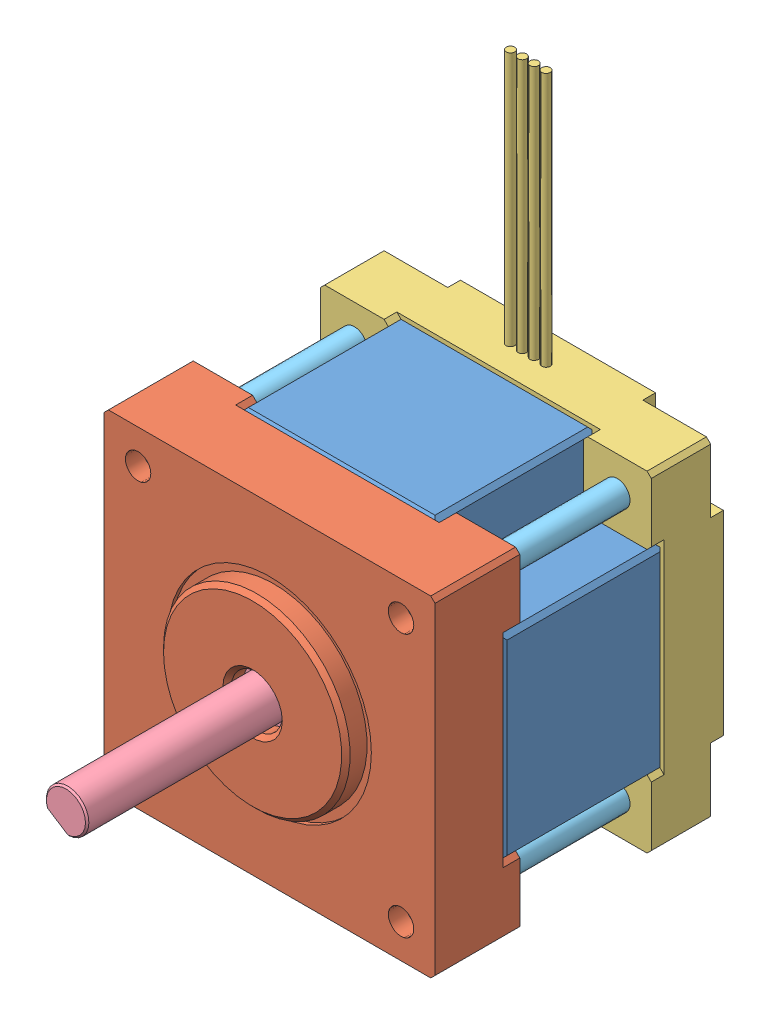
SolidWorks assembly 16HS2404.SLDASM, configuration 默认 (file format 7000). Lengths in mm.
Overall size (39 69 58).
8 component instances, 5 part files, 10 mates.
Components (placement in the parent):
- 定子铁芯-1: 定子铁芯.SLDPRT [默认] at (-13.9383 2.5738 34) size (39 39 19)
- 前端-1: 前端.SLDPRT [默认] at (-13.9383 2.5738 51) size (39 39 12)
- 后端盖-1: 后端盖.SLDPRT [默认] at (-13.9383 2.5738 27) size (39 69 8.5)
- 轴-1: 轴.SLDPRT [默认] at (-13.9383 2.5738 85) x (0.842099 -0.539323 0) z (0 0 -1) size (6 6 55)
- 螺钉-2: 螺钉.SLDPRT [默认] at (-29.4383 -12.9262 27) size (4 4 32)
- 螺钉-3: 螺钉.SLDPRT [默认] at (-29.4383 18.0738 27) size (4 4 32)
- 螺钉-4: 螺钉.SLDPRT [默认] at (1.5617 18.0738 27) size (4 4 32)
- 螺钉-5: 螺钉.SLDPRT [默认] at (1.5617 -12.9262 27) size (4 4 32)
Mates (geometry in assembly coordinates):
- 重合1: coincident anti-aligned: circle of 定子铁芯-1; circle of 前端-1
- 重合2: coincident anti-aligned: plane of 定子铁芯-1 through (-13.9383 -8.9262 53) normal (0 -1 0); plane of 前端-1 through (-13.9383 -8.9262 53) normal (0 1 0)
- 重合3: coincident anti-aligned: circle of 定子铁芯-1; circle of 后端盖-1
- 重合4: coincident anti-aligned: plane of 定子铁芯-1 through (-13.9383 -8.9262 53) normal (0 -1 0); plane of 后端盖-1 through (-13.9383 -8.9262 34) normal (0 1 0)
- 同心1: concentric anti-aligned: circle of 前端-1; circle of 轴-1
- 距离1: distance = 22 mm aligned: plane of 轴-1 through (-13.9383 2.5738 85) normal (0 0 1); plane of 前端-1 through (-13.9383 2.5738 63) normal (0 0 1)
- 重合6: coincident aligned: circle of 后端盖-1; circle of 螺钉-4
- 重合7: coincident aligned: circle of 后端盖-1; circle of 螺钉-5
- 重合8: coincident aligned: circle of 后端盖-1; circle of 螺钉-3
- 重合9: coincident aligned: circle of 后端盖-1; circle of 螺钉-2
